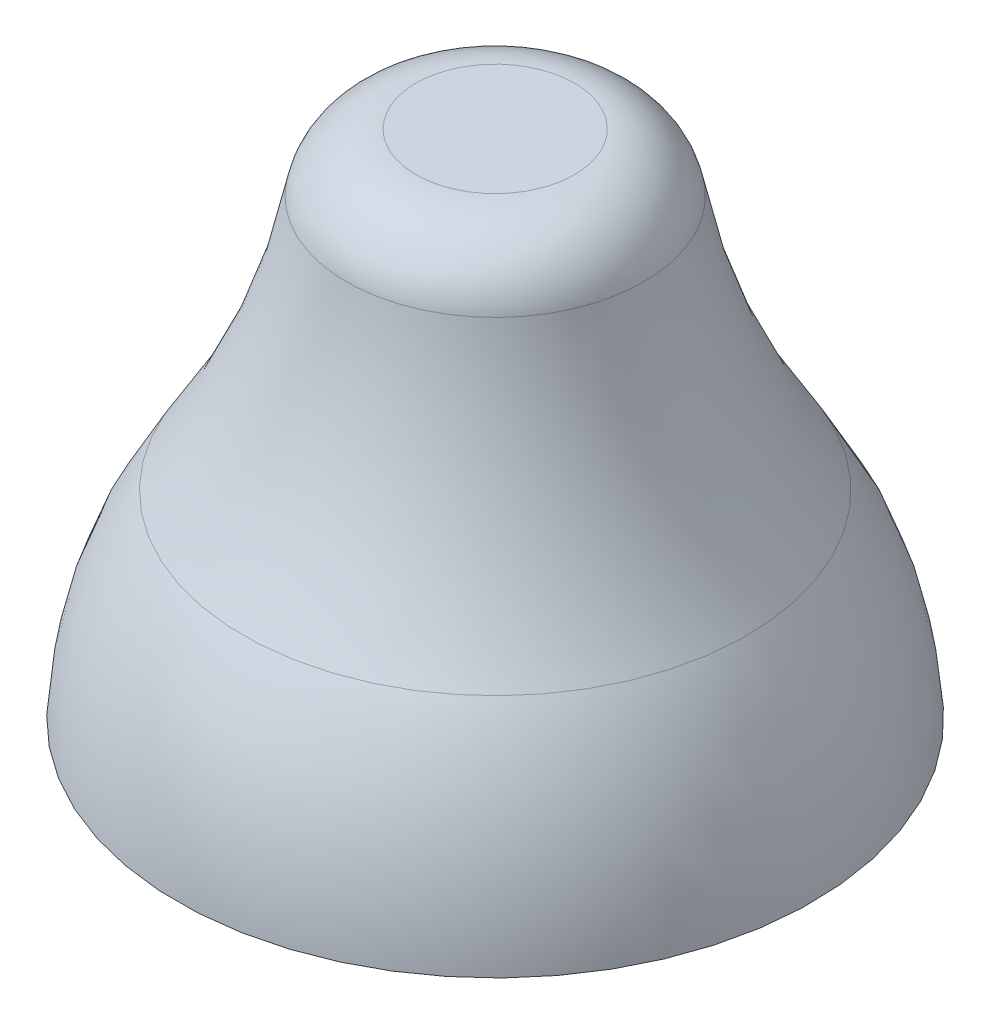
from build123d import *

# Parameters (mm, degrees)
SKETCH2_R          = 0.5
CUT_EXTRUDE1_DEPTH = 0.5


with BuildPart() as part:
    # Sketch1 → Revolve1 (revolve)
    with BuildSketch(Plane.XY, mode=Mode.PRIVATE) as revolve1_sk:
        with BuildLine():
            Line((0, 0), (0.9, 0))
            ThreePointArc((0.9, 0), (0.845516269, 0.293747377), (0.714, 0.562))
            ThreePointArc((0.714, 0.562), (0.530467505, 0.908354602), (0.421913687, 1.285))
            ThreePointArc((0.421913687, 1.285), (0.353452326, 1.403297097), (0.225, 1.45))
            Line((0.225, 1.45), (0, 1.45))
            Line((0, 1.45), (0, 0))
        make_face()
    revolve(revolve1_sk.sketch.rotate(Axis((0, 0, 0), (0, 1, 0)), 90), axis=Axis((0, 0, 0), (0, 1, 0)))

    # Sketch2 → Cut-Extrude1 (cut)
    with BuildSketch(Plane.XZ):
        with Locations(Location((0, 0, 0), (0, 0, 270))):
            Circle(SKETCH2_R)
    extrude(amount=-CUT_EXTRUDE1_DEPTH, mode=Mode.SUBTRACT)


solid = part.part
